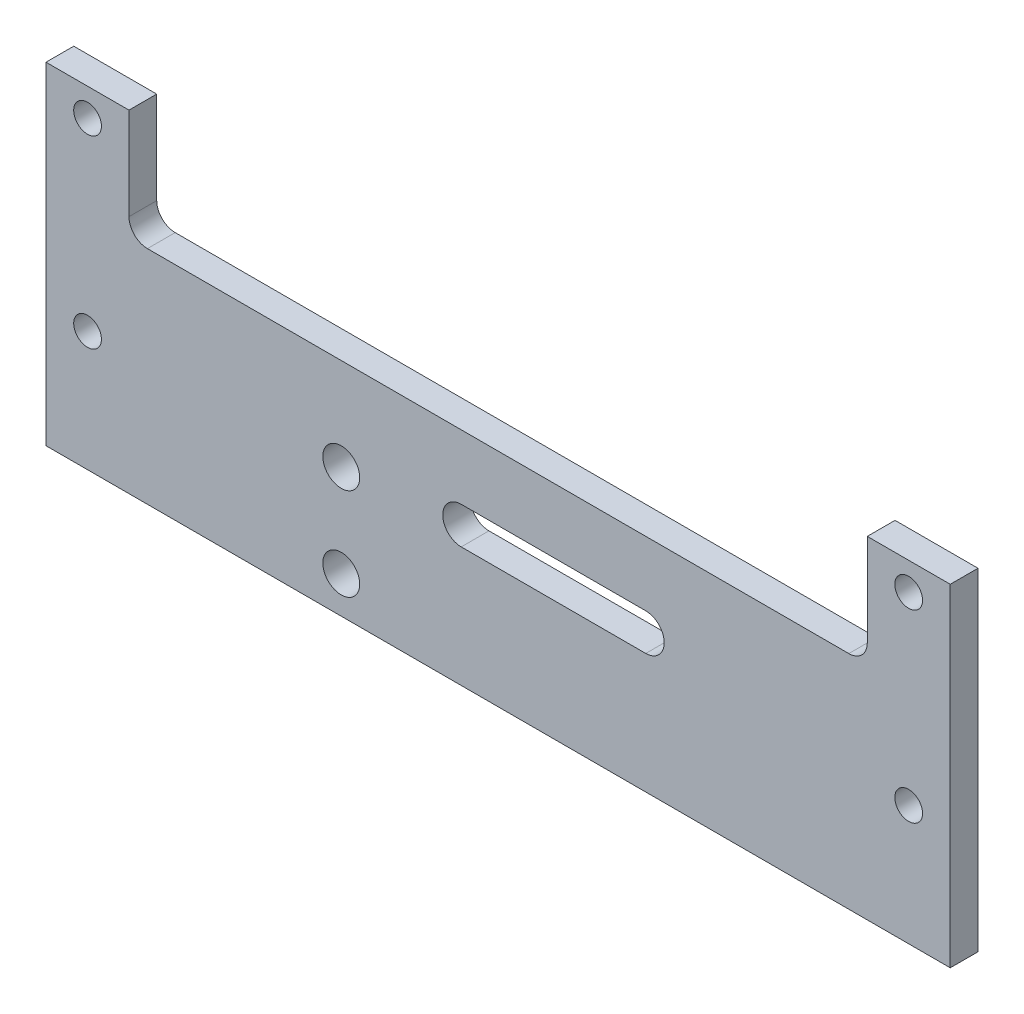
from build123d import *

# Parameters (mm, degrees)
SKETCH2_R           = 2.3876
SKETCH2_R_2         = 3.175
BOSS_EXTRUDE1_DEPTH = 4.7752
FILLET1_R           = 3.175


with BuildPart() as part:
    # Sketch2 → Boss-Extrude1 (new body)
    with BuildSketch(Plane.XY):
        Polygon((-77.7875, 0), (0, 0), (77.7875, 0), (77.7875, 57.15), (63.5127, 57.15), (63.5127, 38.1), (-63.5127, 38.1), (-63.5127, 57.15), (-77.7875, 57.15), align=None)
        with Locations((-70.6374, 20.6248)):
            Circle(SKETCH2_R, mode=Mode.SUBTRACT)
        with Locations((-70.6374, 52.3748)):
            Circle(SKETCH2_R, mode=Mode.SUBTRACT)
        with Locations((70.6374, 20.6248)):
            Circle(SKETCH2_R, mode=Mode.SUBTRACT)
        with Locations((70.6374, 52.3748)):
            Circle(SKETCH2_R, mode=Mode.SUBTRACT)
        with Locations((-26.9875, 6.35)):
            Circle(SKETCH2_R_2, mode=Mode.SUBTRACT)
        with Locations((-26.9875, 22.225)):
            Circle(SKETCH2_R_2, mode=Mode.SUBTRACT)
        with BuildLine():
            Line((-6.35, 20.6502), (25.4, 20.6502))
            ThreePointArc((25.4, 20.6502), (28.575, 23.8252), (25.4, 27.0002))
            Line((25.4, 27.0002), (-6.35, 27.0002))
            ThreePointArc((-6.35, 27.0002), (-9.525, 23.8252), (-6.35, 20.6502))
        make_face(mode=Mode.SUBTRACT)
    extrude(amount=BOSS_EXTRUDE1_DEPTH)

    # Fillet1
    fillet1_edges = [part.edges().sort_by_distance(p)[0] for p in [
        (-63.5127, 38.1, 2.3876),
        (63.5127, 38.1, 2.3876),
    ]]
    fillet(fillet1_edges, radius=FILLET1_R)


solid = part.part
